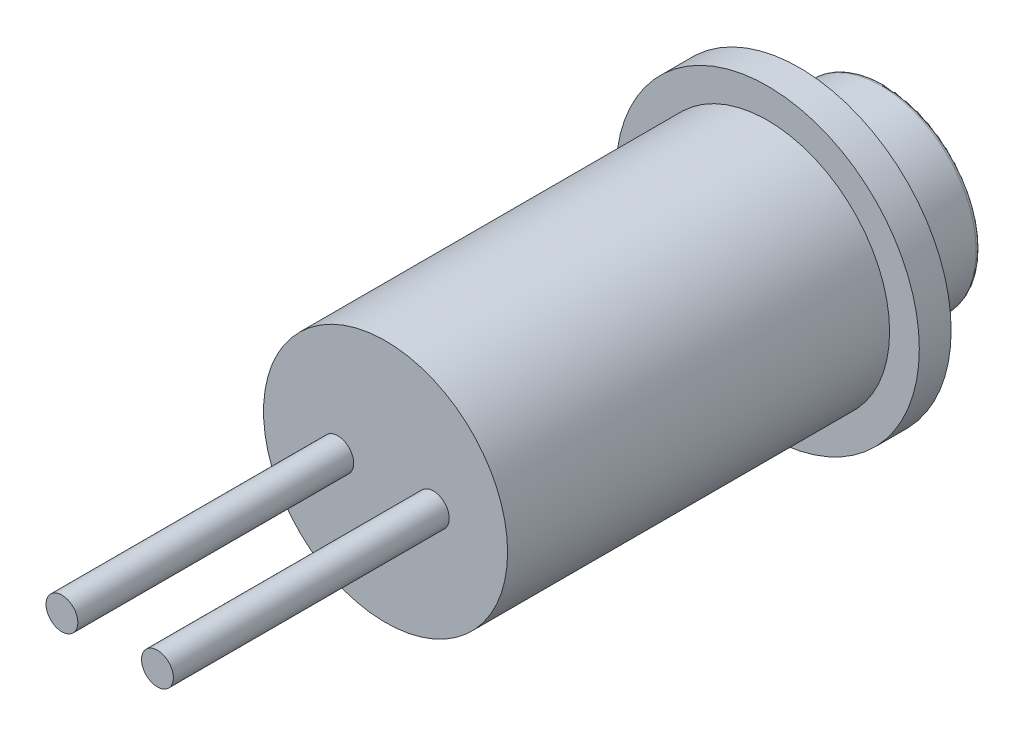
ISO-10303-21;
HEADER;
FILE_DESCRIPTION(('STEP AP214'),'2;1');
FILE_NAME('part.step','',(''),(''),'','','');
FILE_SCHEMA(('AUTOMOTIVE_DESIGN { 1 0 10303 214 1 1 1 1 }'));
ENDSEC;
DATA;
#1=APPLICATION_CONTEXT('core data for automotive mechanical design processes');
#2=APPLICATION_PROTOCOL_DEFINITION('international standard','automotive_design',2000,#1);
#3=PRODUCT_CONTEXT('',#1,'mechanical');
#4=PRODUCT('Part','Part','',(#3));
#5=PRODUCT_RELATED_PRODUCT_CATEGORY('part','',(#4));
#6=PRODUCT_DEFINITION_FORMATION('','',#4);
#7=PRODUCT_DEFINITION_CONTEXT('part definition',#1,'design');
#8=PRODUCT_DEFINITION('design','',#6,#7);
#9=PRODUCT_DEFINITION_SHAPE('','',#8);
#10=(LENGTH_UNIT() NAMED_UNIT(*) SI_UNIT(.MILLI.,.METRE.));
#11=(NAMED_UNIT(*) PLANE_ANGLE_UNIT() SI_UNIT($,.RADIAN.));
#12=(NAMED_UNIT(*) SI_UNIT($,.STERADIAN.) SOLID_ANGLE_UNIT());
#13=UNCERTAINTY_MEASURE_WITH_UNIT(LENGTH_MEASURE(1.E-05),#10,'distance_accuracy_value','');
#14=(GEOMETRIC_REPRESENTATION_CONTEXT(3) GLOBAL_UNCERTAINTY_ASSIGNED_CONTEXT((#13)) GLOBAL_UNIT_ASSIGNED_CONTEXT((#10,
#11,#12)) REPRESENTATION_CONTEXT('',''));
#15=CARTESIAN_POINT('',(0.,0.,0.));
#16=DIRECTION('',(0.,0.,1.));
#17=DIRECTION('',(1.,0.,0.));
#18=AXIS2_PLACEMENT_3D('',#15,#16,#17);
#19=CARTESIAN_POINT('',(0.,0.,18.));
#20=DIRECTION('',(0.,0.,-1.));
#21=DIRECTION('',(-1.,0.,0.));
#22=AXIS2_PLACEMENT_3D('',#19,#20,#21);
#23=CYLINDRICAL_SURFACE('',#22,5.75);
#24=CARTESIAN_POINT('',(0.,0.,18.));
#25=DIRECTION('',(0.,0.,1.));
#26=DIRECTION('',(1.,0.,0.));
#27=AXIS2_PLACEMENT_3D('',#24,#25,#26);
#28=CIRCLE('',#27,5.75);
#29=CARTESIAN_POINT('',(5.75,0.,18.));
#30=VERTEX_POINT('',#29);
#31=EDGE_CURVE('E65',#30,#30,#28,.T.);
#32=ORIENTED_EDGE('',*,*,#31,.F.);
#33=EDGE_LOOP('',(#32));
#34=FACE_BOUND('',#33,.T.);
#35=CARTESIAN_POINT('',(0.,0.,0.));
#36=DIRECTION('',(0.,0.,1.));
#37=DIRECTION('',(1.,0.,0.));
#38=AXIS2_PLACEMENT_3D('',#35,#36,#37);
#39=CIRCLE('',#38,5.75);
#40=CARTESIAN_POINT('',(5.75,0.,0.));
#41=VERTEX_POINT('',#40);
#42=EDGE_CURVE('E66',#41,#41,#39,.T.);
#43=ORIENTED_EDGE('',*,*,#42,.T.);
#44=EDGE_LOOP('',(#43));
#45=FACE_BOUND('',#44,.T.);
#46=ADVANCED_FACE('F45',(#34,#45),#23,.T.);
#47=CARTESIAN_POINT('',(0.,0.,18.));
#48=DIRECTION('',(0.,0.,1.));
#49=DIRECTION('',(1.,0.,0.));
#50=AXIS2_PLACEMENT_3D('',#47,#48,#49);
#51=PLANE('',#50);
#52=CARTESIAN_POINT('',(-2.25,0.,18.));
#53=DIRECTION('',(0.,0.,1.));
#54=DIRECTION('',(-1.,0.,0.));
#55=AXIS2_PLACEMENT_3D('',#52,#53,#54);
#56=CIRCLE('',#55,0.75);
#57=CARTESIAN_POINT('',(-3.,0.,18.));
#58=VERTEX_POINT('',#57);
#59=EDGE_CURVE('E84',#58,#58,#56,.T.);
#60=ORIENTED_EDGE('',*,*,#59,.F.);
#61=EDGE_LOOP('',(#60));
#62=FACE_BOUND('',#61,.T.);
#63=CARTESIAN_POINT('',(2.25,0.,18.));
#64=DIRECTION('',(0.,0.,1.));
#65=DIRECTION('',(1.,0.,0.));
#66=AXIS2_PLACEMENT_3D('',#63,#64,#65);
#67=CIRCLE('',#66,0.75);
#68=CARTESIAN_POINT('',(1.5,0.,18.));
#69=VERTEX_POINT('',#68);
#70=EDGE_CURVE('E78',#69,#69,#67,.T.);
#71=ORIENTED_EDGE('',*,*,#70,.F.);
#72=EDGE_LOOP('',(#71));
#73=FACE_BOUND('',#72,.T.);
#74=ORIENTED_EDGE('',*,*,#31,.T.);
#75=EDGE_LOOP('',(#74));
#76=FACE_BOUND('',#75,.T.);
#77=ADVANCED_FACE('F99',(#62,#73,#76),#51,.T.);
#78=CARTESIAN_POINT('',(0.,0.,-2.5));
#79=DIRECTION('',(0.,0.,1.));
#80=DIRECTION('',(1.,0.,0.));
#81=AXIS2_PLACEMENT_3D('',#78,#79,#80);
#82=CYLINDRICAL_SURFACE('',#81,7.15);
#83=CARTESIAN_POINT('',(0.,0.,-1.5));
#84=DIRECTION('',(0.,0.,1.));
#85=DIRECTION('',(1.,0.,0.));
#86=AXIS2_PLACEMENT_3D('',#83,#84,#85);
#87=CIRCLE('',#86,7.15);
#88=CARTESIAN_POINT('',(7.15,0.,-1.5));
#89=VERTEX_POINT('',#88);
#90=EDGE_CURVE('E60',#89,#89,#87,.T.);
#91=ORIENTED_EDGE('',*,*,#90,.T.);
#92=EDGE_LOOP('',(#91));
#93=FACE_BOUND('',#92,.T.);
#94=CARTESIAN_POINT('',(0.,0.,0.));
#95=DIRECTION('',(0.,0.,1.));
#96=DIRECTION('',(1.,0.,0.));
#97=AXIS2_PLACEMENT_3D('',#94,#95,#96);
#98=CIRCLE('',#97,7.15);
#99=CARTESIAN_POINT('',(7.15,0.,0.));
#100=VERTEX_POINT('',#99);
#101=EDGE_CURVE('E69',#100,#100,#98,.T.);
#102=ORIENTED_EDGE('',*,*,#101,.F.);
#103=EDGE_LOOP('',(#102));
#104=FACE_BOUND('',#103,.T.);
#105=ADVANCED_FACE('F102',(#93,#104),#82,.T.);
#106=CARTESIAN_POINT('',(0.,0.,-2.5));
#107=DIRECTION('',(0.,0.,1.));
#108=DIRECTION('',(1.,0.,0.));
#109=AXIS2_PLACEMENT_3D('',#106,#107,#108);
#110=PLANE('',#109);
#111=CARTESIAN_POINT('',(0.,0.,-2.5));
#112=DIRECTION('',(0.,0.,1.));
#113=DIRECTION('',(1.,0.,0.));
#114=AXIS2_PLACEMENT_3D('',#111,#112,#113);
#115=CIRCLE('',#114,4.5);
#116=CARTESIAN_POINT('',(4.5,0.,-2.5));
#117=VERTEX_POINT('',#116);
#118=EDGE_CURVE('E74',#117,#117,#115,.T.);
#119=ORIENTED_EDGE('',*,*,#118,.T.);
#120=EDGE_LOOP('',(#119));
#121=FACE_BOUND('',#120,.T.);
#122=CARTESIAN_POINT('',(0.,0.,-2.5));
#123=DIRECTION('',(0.,0.,1.));
#124=DIRECTION('',(1.,0.,0.));
#125=AXIS2_PLACEMENT_3D('',#122,#123,#124);
#126=CIRCLE('',#125,5.65);
#127=CARTESIAN_POINT('',(5.65,0.,-2.5));
#128=VERTEX_POINT('',#127);
#129=EDGE_CURVE('E56',#128,#128,#126,.F.);
#130=ORIENTED_EDGE('',*,*,#129,.T.);
#131=EDGE_LOOP('',(#130));
#132=FACE_BOUND('',#131,.T.);
#133=ADVANCED_FACE('F117',(#121,#132),#110,.F.);
#134=CARTESIAN_POINT('',(0.,0.,0.));
#135=DIRECTION('',(0.,0.,1.));
#136=DIRECTION('',(1.,0.,0.));
#137=AXIS2_PLACEMENT_3D('',#134,#135,#136);
#138=PLANE('',#137);
#139=ORIENTED_EDGE('',*,*,#42,.F.);
#140=EDGE_LOOP('',(#139));
#141=FACE_BOUND('',#140,.T.);
#142=ORIENTED_EDGE('',*,*,#101,.T.);
#143=EDGE_LOOP('',(#142));
#144=FACE_BOUND('',#143,.T.);
#145=ADVANCED_FACE('F113',(#141,#144),#138,.T.);
#146=CARTESIAN_POINT('',(0.,0.,-1.5));
#147=DIRECTION('',(0.,0.,1.));
#148=DIRECTION('',(1.,0.,0.));
#149=AXIS2_PLACEMENT_3D('',#146,#147,#148);
#150=CONICAL_SURFACE('',#149,7.15,0.98279372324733);
#151=ORIENTED_EDGE('',*,*,#129,.F.);
#152=EDGE_LOOP('',(#151));
#153=FACE_BOUND('',#152,.T.);
#154=ORIENTED_EDGE('',*,*,#90,.F.);
#155=EDGE_LOOP('',(#154));
#156=FACE_BOUND('',#155,.T.);
#157=ADVANCED_FACE('F116',(#153,#156),#150,.T.);
#158=CARTESIAN_POINT('',(0.,0.,19.0916652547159));
#159=DIRECTION('',(0.,0.,1.));
#160=DIRECTION('',(1.,0.,0.));
#161=AXIS2_PLACEMENT_3D('',#158,#159,#160);
#162=SPHERICAL_SURFACE('',#161,25.);
#163=CARTESIAN_POINT('',(0.,0.,-5.5296785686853));
#164=DIRECTION('',(0.,0.,1.));
#165=DIRECTION('',(1.,0.,0.));
#166=AXIS2_PLACEMENT_3D('',#163,#164,#165);
#167=CIRCLE('',#166,4.33467741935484);
#168=CARTESIAN_POINT('',(4.33467741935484,0.,-5.5296785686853));
#169=VERTEX_POINT('',#168);
#170=EDGE_CURVE('E10',#169,#169,#167,.F.);
#171=ORIENTED_EDGE('',*,*,#170,.T.);
#172=EDGE_LOOP('',(#171));
#173=FACE_BOUND('',#172,.T.);
#174=ADVANCED_FACE('F133',(#173),#162,.T.);
#175=CARTESIAN_POINT('',(0.,0.,0.));
#176=DIRECTION('',(0.,0.,1.));
#177=DIRECTION('',(1.,0.,0.));
#178=AXIS2_PLACEMENT_3D('',#175,#176,#177);
#179=CYLINDRICAL_SURFACE('',#178,4.5);
#180=CARTESIAN_POINT('',(0.,0.,-5.3327078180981));
#181=DIRECTION('',(0.,0.,1.));
#182=DIRECTION('',(1.,0.,0.));
#183=AXIS2_PLACEMENT_3D('',#180,#181,#182);
#184=CIRCLE('',#183,4.5);
#185=CARTESIAN_POINT('',(4.5,0.,-5.3327078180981));
#186=VERTEX_POINT('',#185);
#187=EDGE_CURVE('E52',#186,#186,#184,.T.);
#188=ORIENTED_EDGE('',*,*,#187,.T.);
#189=EDGE_LOOP('',(#188));
#190=FACE_BOUND('',#189,.T.);
#191=ORIENTED_EDGE('',*,*,#118,.F.);
#192=EDGE_LOOP('',(#191));
#193=FACE_BOUND('',#192,.T.);
#194=ADVANCED_FACE('F138',(#190,#193),#179,.T.);
#195=CARTESIAN_POINT('',(0.,0.,-5.3327078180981));
#196=DIRECTION('',(0.,0.,1.));
#197=DIRECTION('',(1.,0.,0.));
#198=AXIS2_PLACEMENT_3D('',#195,#196,#197);
#199=TOROIDAL_SURFACE('',#198,4.3,0.2);
#200=ORIENTED_EDGE('',*,*,#170,.F.);
#201=EDGE_LOOP('',(#200));
#202=FACE_BOUND('',#201,.T.);
#203=ORIENTED_EDGE('',*,*,#187,.F.);
#204=EDGE_LOOP('',(#203));
#205=FACE_BOUND('',#204,.T.);
#206=ADVANCED_FACE('F47',(#202,#205),#199,.T.);
#207=CARTESIAN_POINT('',(2.25,0.,31.));
#208=DIRECTION('',(0.,0.,-1.));
#209=DIRECTION('',(-1.,0.,0.));
#210=AXIS2_PLACEMENT_3D('',#207,#208,#209);
#211=CYLINDRICAL_SURFACE('',#210,0.75);
#212=CARTESIAN_POINT('',(2.25,0.,31.));
#213=DIRECTION('',(0.,0.,1.));
#214=DIRECTION('',(1.,0.,0.));
#215=AXIS2_PLACEMENT_3D('',#212,#213,#214);
#216=CIRCLE('',#215,0.75);
#217=CARTESIAN_POINT('',(1.5,0.,31.));
#218=VERTEX_POINT('',#217);
#219=EDGE_CURVE('E77',#218,#218,#216,.T.);
#220=CARTESIAN_POINT('',(1.5,0.,31.));
#221=CARTESIAN_POINT('',(1.5,0.,30.8645833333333));
#222=CARTESIAN_POINT('',(1.5,0.,30.7291666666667));
#223=CARTESIAN_POINT('',(1.5,0.,30.4583333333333));
#224=CARTESIAN_POINT('',(1.5,0.,30.3229166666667));
#225=CARTESIAN_POINT('',(1.5,0.,30.0520833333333));
#226=CARTESIAN_POINT('',(1.5,0.,29.9166666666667));
#227=CARTESIAN_POINT('',(1.5,0.,29.6458333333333));
#228=CARTESIAN_POINT('',(1.5,0.,29.5104166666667));
#229=CARTESIAN_POINT('',(1.5,0.,29.2395833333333));
#230=CARTESIAN_POINT('',(1.5,0.,29.1041666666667));
#231=CARTESIAN_POINT('',(1.5,0.,28.8333333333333));
#232=CARTESIAN_POINT('',(1.5,0.,28.6979166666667));
#233=CARTESIAN_POINT('',(1.5,0.,28.4270833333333));
#234=CARTESIAN_POINT('',(1.5,0.,28.2916666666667));
#235=CARTESIAN_POINT('',(1.5,0.,28.0208333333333));
#236=CARTESIAN_POINT('',(1.5,0.,27.8854166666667));
#237=CARTESIAN_POINT('',(1.5,0.,27.6145833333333));
#238=CARTESIAN_POINT('',(1.5,0.,27.4791666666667));
#239=CARTESIAN_POINT('',(1.5,0.,27.2083333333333));
#240=CARTESIAN_POINT('',(1.5,0.,27.0729166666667));
#241=CARTESIAN_POINT('',(1.5,0.,26.8020833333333));
#242=CARTESIAN_POINT('',(1.5,0.,26.6666666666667));
#243=CARTESIAN_POINT('',(1.5,0.,26.3958333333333));
#244=CARTESIAN_POINT('',(1.5,0.,26.2604166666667));
#245=CARTESIAN_POINT('',(1.5,0.,25.9895833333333));
#246=CARTESIAN_POINT('',(1.5,0.,25.8541666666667));
#247=CARTESIAN_POINT('',(1.5,0.,25.5833333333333));
#248=CARTESIAN_POINT('',(1.5,0.,25.4479166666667));
#249=CARTESIAN_POINT('',(1.5,0.,25.1770833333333));
#250=CARTESIAN_POINT('',(1.5,0.,25.0416666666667));
#251=CARTESIAN_POINT('',(1.5,0.,24.7708333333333));
#252=CARTESIAN_POINT('',(1.5,0.,24.6354166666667));
#253=CARTESIAN_POINT('',(1.5,0.,24.3645833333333));
#254=CARTESIAN_POINT('',(1.5,0.,24.2291666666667));
#255=CARTESIAN_POINT('',(1.5,0.,23.9583333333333));
#256=CARTESIAN_POINT('',(1.5,0.,23.8229166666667));
#257=CARTESIAN_POINT('',(1.5,0.,23.5520833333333));
#258=CARTESIAN_POINT('',(1.5,0.,23.4166666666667));
#259=CARTESIAN_POINT('',(1.5,0.,23.1458333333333));
#260=CARTESIAN_POINT('',(1.5,0.,23.0104166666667));
#261=CARTESIAN_POINT('',(1.5,0.,22.7395833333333));
#262=CARTESIAN_POINT('',(1.5,0.,22.6041666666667));
#263=CARTESIAN_POINT('',(1.5,0.,22.3333333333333));
#264=CARTESIAN_POINT('',(1.5,0.,22.1979166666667));
#265=CARTESIAN_POINT('',(1.5,0.,21.9270833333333));
#266=CARTESIAN_POINT('',(1.5,0.,21.7916666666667));
#267=CARTESIAN_POINT('',(1.5,0.,21.5208333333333));
#268=CARTESIAN_POINT('',(1.5,0.,21.3854166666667));
#269=CARTESIAN_POINT('',(1.5,0.,21.1145833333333));
#270=CARTESIAN_POINT('',(1.5,0.,20.9791666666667));
#271=CARTESIAN_POINT('',(1.5,0.,20.7083333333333));
#272=CARTESIAN_POINT('',(1.5,0.,20.5729166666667));
#273=CARTESIAN_POINT('',(1.5,0.,20.3020833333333));
#274=CARTESIAN_POINT('',(1.5,0.,20.1666666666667));
#275=CARTESIAN_POINT('',(1.5,0.,19.8958333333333));
#276=CARTESIAN_POINT('',(1.5,0.,19.7604166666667));
#277=CARTESIAN_POINT('',(1.5,0.,19.4895833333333));
#278=CARTESIAN_POINT('',(1.5,0.,19.3541666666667));
#279=CARTESIAN_POINT('',(1.5,0.,19.0833333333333));
#280=CARTESIAN_POINT('',(1.5,0.,18.9479166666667));
#281=CARTESIAN_POINT('',(1.5,0.,18.6770833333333));
#282=CARTESIAN_POINT('',(1.5,0.,18.5416666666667));
#283=CARTESIAN_POINT('',(1.5,0.,18.2708333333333));
#284=CARTESIAN_POINT('',(1.5,0.,18.1354166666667));
#285=CARTESIAN_POINT('',(1.5,0.,18.));
#286=B_SPLINE_CURVE_WITH_KNOTS('',3,(#220,#221,#222,#223,#224,#225,#226,#227,#228,#229,#230,
#231,#232,#233,#234,#235,#236,#237,#238,#239,#240,#241,#242,#243,#244,#245,#246,#247,#248,#249,
#250,#251,#252,#253,#254,#255,#256,#257,#258,#259,#260,#261,#262,#263,#264,#265,#266,#267,#268,
#269,#270,#271,#272,#273,#274,#275,#276,#277,#278,#279,#280,#281,#282,#283,#284,#285),
.UNSPECIFIED.,.F.,.F.,(4,2,2,2,2,2,2,2,2,2,2,2,2,2,2,2,2,2,2,2,2,2,2,2,2,2,2,2,2,2,2,2,4),(0.,
0.406249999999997,0.812499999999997,1.21875,1.625,2.03125,2.4375,2.84375,3.25,3.65625,4.0625,
4.46875,4.875,5.28125,5.6875,6.09375,6.5,6.90625,7.3125,7.71875,8.125,8.53125,8.9375,9.34375,
9.75,10.15625,10.5625,10.96875,11.375,11.78125,12.1875,12.59375,13.),.UNSPECIFIED.);
#287=EDGE_CURVE('BSEAM149',#218,#69,#286,.T.);
#288=ORIENTED_EDGE('',*,*,#219,.F.);
#289=ORIENTED_EDGE('',*,*,#70,.T.);
#290=ORIENTED_EDGE('',*,*,#287,.T.);
#291=ORIENTED_EDGE('',*,*,#287,.F.);
#292=EDGE_LOOP('',(#288,#290,#289,#291));
#293=FACE_BOUND('',#292,.T.);
#294=ADVANCED_FACE('F149',(#293),#211,.T.);
#295=CARTESIAN_POINT('',(2.25,0.,31.));
#296=DIRECTION('',(0.,0.,1.));
#297=DIRECTION('',(1.,0.,0.));
#298=AXIS2_PLACEMENT_3D('',#295,#296,#297);
#299=PLANE('',#298);
#300=ORIENTED_EDGE('',*,*,#219,.T.);
#301=EDGE_LOOP('',(#300));
#302=FACE_BOUND('',#301,.T.);
#303=ADVANCED_FACE('F95',(#302),#299,.T.);
#304=CARTESIAN_POINT('',(-2.25,0.,31.));
#305=DIRECTION('',(0.,0.,-1.));
#306=DIRECTION('',(-1.,0.,0.));
#307=AXIS2_PLACEMENT_3D('',#304,#305,#306);
#308=CYLINDRICAL_SURFACE('',#307,0.75);
#309=CARTESIAN_POINT('',(-2.25,0.,31.));
#310=DIRECTION('',(0.,0.,1.));
#311=DIRECTION('',(-1.,0.,0.));
#312=AXIS2_PLACEMENT_3D('',#309,#310,#311);
#313=CIRCLE('',#312,0.75);
#314=CARTESIAN_POINT('',(-3.,0.,31.));
#315=VERTEX_POINT('',#314);
#316=EDGE_CURVE('E81',#315,#315,#313,.T.);
#317=CARTESIAN_POINT('',(-3.,0.,31.));
#318=CARTESIAN_POINT('',(-3.,0.,30.8645833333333));
#319=CARTESIAN_POINT('',(-3.,0.,30.7291666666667));
#320=CARTESIAN_POINT('',(-3.,0.,30.4583333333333));
#321=CARTESIAN_POINT('',(-3.,0.,30.3229166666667));
#322=CARTESIAN_POINT('',(-3.,0.,30.0520833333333));
#323=CARTESIAN_POINT('',(-3.,0.,29.9166666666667));
#324=CARTESIAN_POINT('',(-3.,0.,29.6458333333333));
#325=CARTESIAN_POINT('',(-3.,0.,29.5104166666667));
#326=CARTESIAN_POINT('',(-3.,0.,29.2395833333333));
#327=CARTESIAN_POINT('',(-3.,0.,29.1041666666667));
#328=CARTESIAN_POINT('',(-3.,0.,28.8333333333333));
#329=CARTESIAN_POINT('',(-3.,0.,28.6979166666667));
#330=CARTESIAN_POINT('',(-3.,0.,28.4270833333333));
#331=CARTESIAN_POINT('',(-3.,0.,28.2916666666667));
#332=CARTESIAN_POINT('',(-3.,0.,28.0208333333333));
#333=CARTESIAN_POINT('',(-3.,0.,27.8854166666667));
#334=CARTESIAN_POINT('',(-3.,0.,27.6145833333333));
#335=CARTESIAN_POINT('',(-3.,0.,27.4791666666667));
#336=CARTESIAN_POINT('',(-3.,0.,27.2083333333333));
#337=CARTESIAN_POINT('',(-3.,0.,27.0729166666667));
#338=CARTESIAN_POINT('',(-3.,0.,26.8020833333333));
#339=CARTESIAN_POINT('',(-3.,0.,26.6666666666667));
#340=CARTESIAN_POINT('',(-3.,0.,26.3958333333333));
#341=CARTESIAN_POINT('',(-3.,0.,26.2604166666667));
#342=CARTESIAN_POINT('',(-3.,0.,25.9895833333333));
#343=CARTESIAN_POINT('',(-3.,0.,25.8541666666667));
#344=CARTESIAN_POINT('',(-3.,0.,25.5833333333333));
#345=CARTESIAN_POINT('',(-3.,0.,25.4479166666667));
#346=CARTESIAN_POINT('',(-3.,0.,25.1770833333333));
#347=CARTESIAN_POINT('',(-3.,0.,25.0416666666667));
#348=CARTESIAN_POINT('',(-3.,0.,24.7708333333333));
#349=CARTESIAN_POINT('',(-3.,0.,24.6354166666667));
#350=CARTESIAN_POINT('',(-3.,0.,24.3645833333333));
#351=CARTESIAN_POINT('',(-3.,0.,24.2291666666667));
#352=CARTESIAN_POINT('',(-3.,0.,23.9583333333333));
#353=CARTESIAN_POINT('',(-3.,0.,23.8229166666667));
#354=CARTESIAN_POINT('',(-3.,0.,23.5520833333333));
#355=CARTESIAN_POINT('',(-3.,0.,23.4166666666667));
#356=CARTESIAN_POINT('',(-3.,0.,23.1458333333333));
#357=CARTESIAN_POINT('',(-3.,0.,23.0104166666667));
#358=CARTESIAN_POINT('',(-3.,0.,22.7395833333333));
#359=CARTESIAN_POINT('',(-3.,0.,22.6041666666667));
#360=CARTESIAN_POINT('',(-3.,0.,22.3333333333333));
#361=CARTESIAN_POINT('',(-3.,0.,22.1979166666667));
#362=CARTESIAN_POINT('',(-3.,0.,21.9270833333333));
#363=CARTESIAN_POINT('',(-3.,0.,21.7916666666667));
#364=CARTESIAN_POINT('',(-3.,0.,21.5208333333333));
#365=CARTESIAN_POINT('',(-3.,0.,21.3854166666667));
#366=CARTESIAN_POINT('',(-3.,0.,21.1145833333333));
#367=CARTESIAN_POINT('',(-3.,0.,20.9791666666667));
#368=CARTESIAN_POINT('',(-3.,0.,20.7083333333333));
#369=CARTESIAN_POINT('',(-3.,0.,20.5729166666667));
#370=CARTESIAN_POINT('',(-3.,0.,20.3020833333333));
#371=CARTESIAN_POINT('',(-3.,0.,20.1666666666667));
#372=CARTESIAN_POINT('',(-3.,0.,19.8958333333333));
#373=CARTESIAN_POINT('',(-3.,0.,19.7604166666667));
#374=CARTESIAN_POINT('',(-3.,0.,19.4895833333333));
#375=CARTESIAN_POINT('',(-3.,0.,19.3541666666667));
#376=CARTESIAN_POINT('',(-3.,0.,19.0833333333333));
#377=CARTESIAN_POINT('',(-3.,0.,18.9479166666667));
#378=CARTESIAN_POINT('',(-3.,0.,18.6770833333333));
#379=CARTESIAN_POINT('',(-3.,0.,18.5416666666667));
#380=CARTESIAN_POINT('',(-3.,0.,18.2708333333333));
#381=CARTESIAN_POINT('',(-3.,0.,18.1354166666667));
#382=CARTESIAN_POINT('',(-3.,0.,18.));
#383=B_SPLINE_CURVE_WITH_KNOTS('',3,(#317,#318,#319,#320,#321,#322,#323,#324,#325,#326,#327,
#328,#329,#330,#331,#332,#333,#334,#335,#336,#337,#338,#339,#340,#341,#342,#343,#344,#345,#346,
#347,#348,#349,#350,#351,#352,#353,#354,#355,#356,#357,#358,#359,#360,#361,#362,#363,#364,#365,
#366,#367,#368,#369,#370,#371,#372,#373,#374,#375,#376,#377,#378,#379,#380,#381,#382),
.UNSPECIFIED.,.F.,.F.,(4,2,2,2,2,2,2,2,2,2,2,2,2,2,2,2,2,2,2,2,2,2,2,2,2,2,2,2,2,2,2,2,4),(0.,
0.406249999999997,0.812499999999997,1.21875,1.625,2.03125,2.4375,2.84375,3.25,3.65625,4.0625,
4.46875,4.875,5.28125,5.6875,6.09375,6.5,6.90625,7.3125,7.71875,8.125,8.53125,8.9375,9.34375,
9.75,10.15625,10.5625,10.96875,11.375,11.78125,12.1875,12.59375,13.),.UNSPECIFIED.);
#384=EDGE_CURVE('BSEAM92',#315,#58,#383,.T.);
#385=ORIENTED_EDGE('',*,*,#316,.F.);
#386=ORIENTED_EDGE('',*,*,#59,.T.);
#387=ORIENTED_EDGE('',*,*,#384,.T.);
#388=ORIENTED_EDGE('',*,*,#384,.F.);
#389=EDGE_LOOP('',(#385,#387,#386,#388));
#390=FACE_BOUND('',#389,.T.);
#391=ADVANCED_FACE('F92',(#390),#308,.T.);
#392=CARTESIAN_POINT('',(-2.25,0.,31.));
#393=DIRECTION('',(0.,0.,-1.));
#394=DIRECTION('',(-1.,0.,0.));
#395=AXIS2_PLACEMENT_3D('',#392,#393,#394);
#396=PLANE('',#395);
#397=ORIENTED_EDGE('',*,*,#316,.T.);
#398=EDGE_LOOP('',(#397));
#399=FACE_BOUND('',#398,.T.);
#400=ADVANCED_FACE('F90',(#399),#396,.F.);
#401=CLOSED_SHELL('',(#46,#77,#105,#133,#145,#157,#174,#194,#206,#294,#303,#391,#400));
#402=MANIFOLD_SOLID_BREP('B2',#401);
#403=ADVANCED_BREP_SHAPE_REPRESENTATION('',(#18,#402),#14);
#404=SHAPE_DEFINITION_REPRESENTATION(#9,#403);
ENDSEC;
END-ISO-10303-21;
